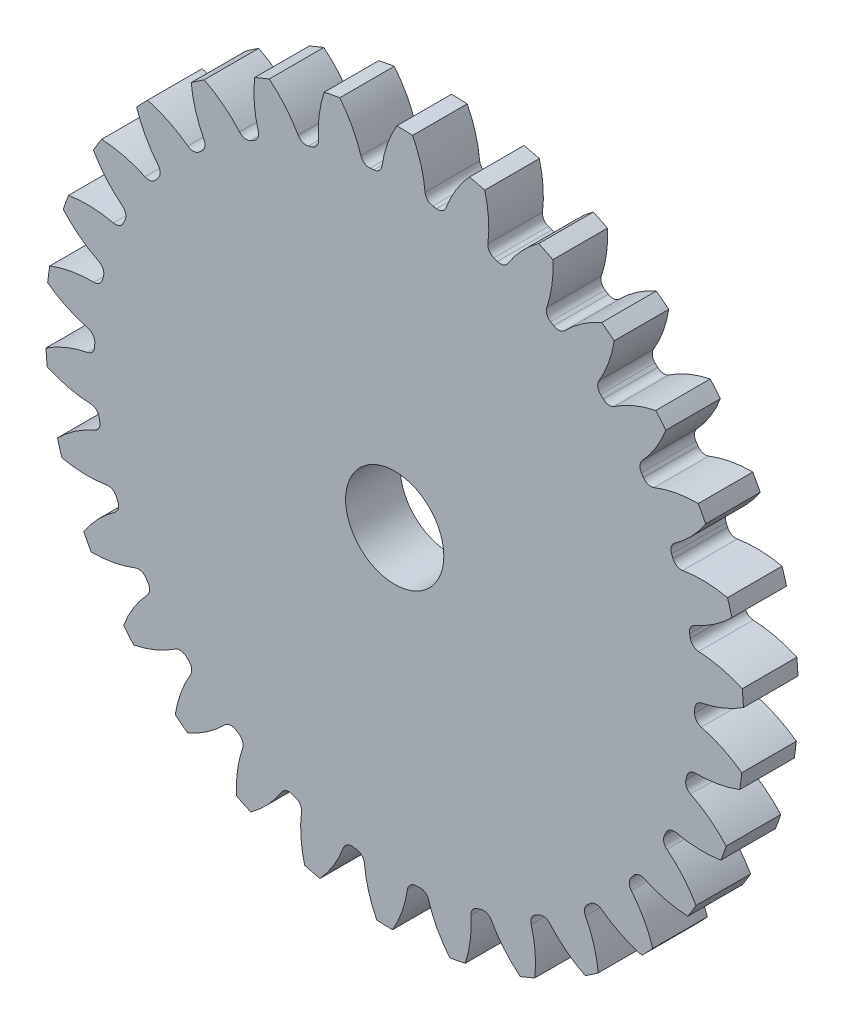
from build123d import *

# Parameters (mm, degrees)
SKETCH3_R         = 812.8
GEARBODY_DEPTH    = 127
TOOTHCUT_DEPTH    = 1157.467327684
CIRPATTERN1_COUNT = 30
BOREDIA_R         = 114.3
BORE_DEPTH        = 12700


with BuildPart() as part:
    # Sketch3 → gearBody (new body)
    with BuildSketch(Plane.XY):
        Circle(SKETCH3_R)
    extrude(amount=GEARBODY_DEPTH)

    # Sketch2 → toothCut (cut, through all)
    with BuildSketch(Plane.XY):
        with BuildLine():
            ThreePointArc((698.072607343, -24.431227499), (698.211433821, -20.075947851), (698.323087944, -15.719886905))
            ThreePointArc((698.323087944, -15.719886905), (703.165603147, -2.882577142), (714.97811368, 4.096754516))
            ThreePointArc((714.97811368, 4.096754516), (765.831147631, 19.387881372), (812.8, 44.162395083))
            ThreePointArc((812.8, 44.162395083), (813.662586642, -23.395560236), (808.919593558, -90.792336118))
            ThreePointArc((808.919593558, -90.792336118), (763.4518665, -63.359957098), (713.561466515, -45.17211468))
            ThreePointArc((713.561466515, -45.17211468), (702.169499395, -37.525575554), (698.072607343, -24.431227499))
        make_face()
    toothcut = extrude(amount=TOOTHCUT_DEPTH, mode=Mode.SUBTRACT)

    # CirPattern1: toothCut ×30 about axis
    cirpattern1_axis = Axis((0, 0, 0), (0, 0, 1))
    for i in range(1, CIRPATTERN1_COUNT):
        add(toothcut.rotate(cirpattern1_axis, i * 360 / CIRPATTERN1_COUNT), mode=Mode.SUBTRACT)

    # boreDia → bore (cut, symmetric)
    with BuildSketch(Plane.XY):
        Circle(BOREDIA_R)
    extrude(amount=BORE_DEPTH, both=True, mode=Mode.SUBTRACT)


solid = part.part
